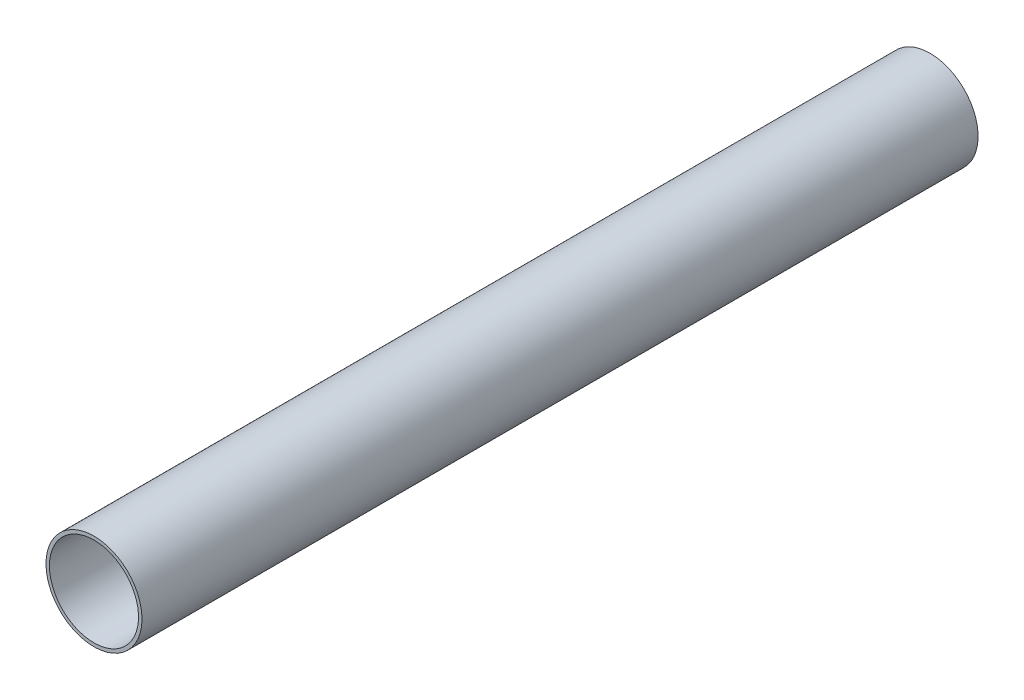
from build123d import *

# Parameters (mm, degrees)
ESQUISSE1_R        = 14
ESQUISSE1_R_2      = 13
EXTRU_MINCE1_DEPTH = 244


with BuildPart() as part:
    # Esquisse1 → Extru.-Mince1 (new body)
    with BuildSketch(Plane.XY):
        with Locations((0, -2.123583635)):
            Circle(ESQUISSE1_R)
        with Locations((0, -2.123583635)):
            Circle(ESQUISSE1_R_2, mode=Mode.SUBTRACT)
    extrude(amount=EXTRU_MINCE1_DEPTH)


solid = part.part
